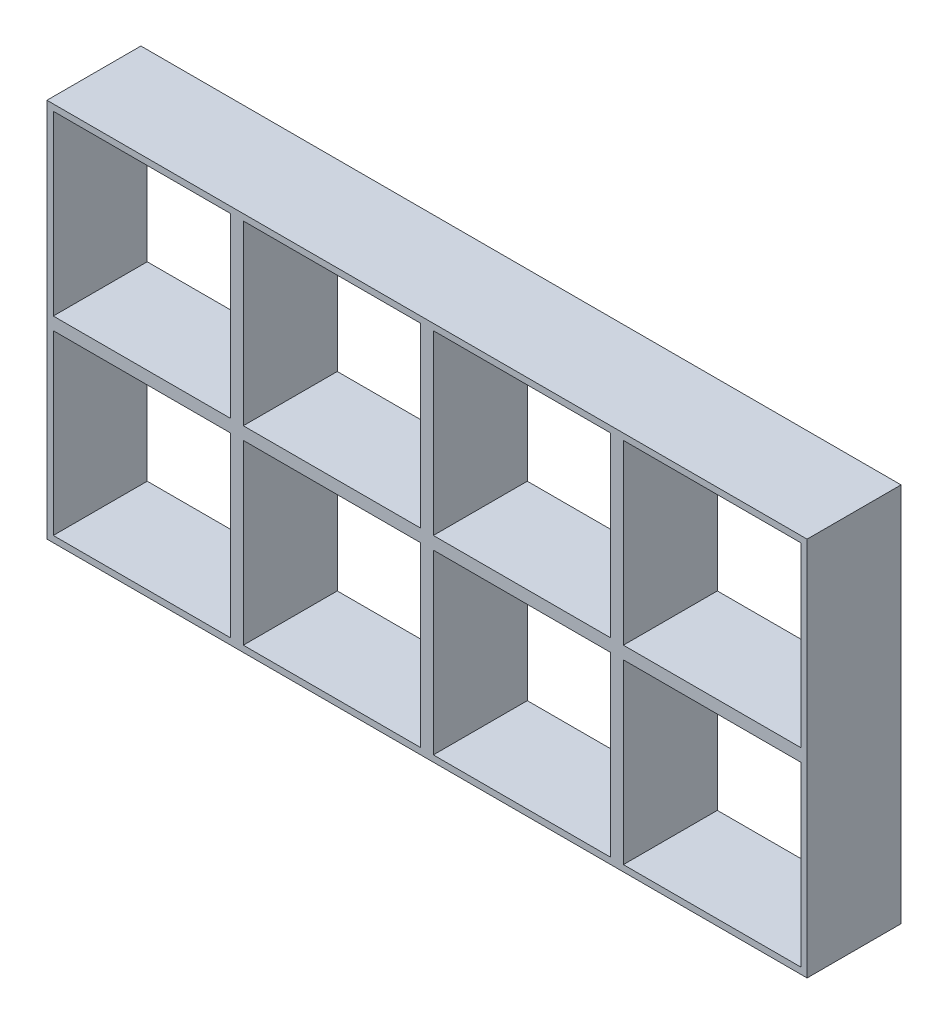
from build123d import *

# Parameters (mm, degrees)
ESQUISSE1_W        = 120
ESQUISSE1_H        = 30
ESQUISSE1_W_2      = 28
ESQUISSE1_H_2      = 28
BOSS_EXTRU_1_DEPTH = 14.833333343


with BuildPart() as part:
    # Esquisse1 → Boss.-Extru.1 (new body)
    with BuildSketch(Plane.XY):
        with Locations((60, 15)):
            Rectangle(ESQUISSE1_W, ESQUISSE1_H)
        with Locations((45, 15)):
            Rectangle(ESQUISSE1_W_2, ESQUISSE1_H_2, mode=Mode.SUBTRACT)
        with Locations((75, 15)):
            Rectangle(ESQUISSE1_W_2, ESQUISSE1_H_2, mode=Mode.SUBTRACT)
        with Locations((105, 15)):
            Rectangle(ESQUISSE1_W_2, ESQUISSE1_H_2, mode=Mode.SUBTRACT)
        with Locations((15, 15)):
            Rectangle(ESQUISSE1_W_2, ESQUISSE1_H_2, mode=Mode.SUBTRACT)
    boss_extru_1 = extrude(amount=BOSS_EXTRU_1_DEPTH)

    # Sym_trie1: Boss.-Extru.1 across plane
    add(boss_extru_1.mirror(Plane(origin=(0, 0, 14.833333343), x_dir=(0, 0, 1), z_dir=(0, 1, 0))))


solid = part.part
